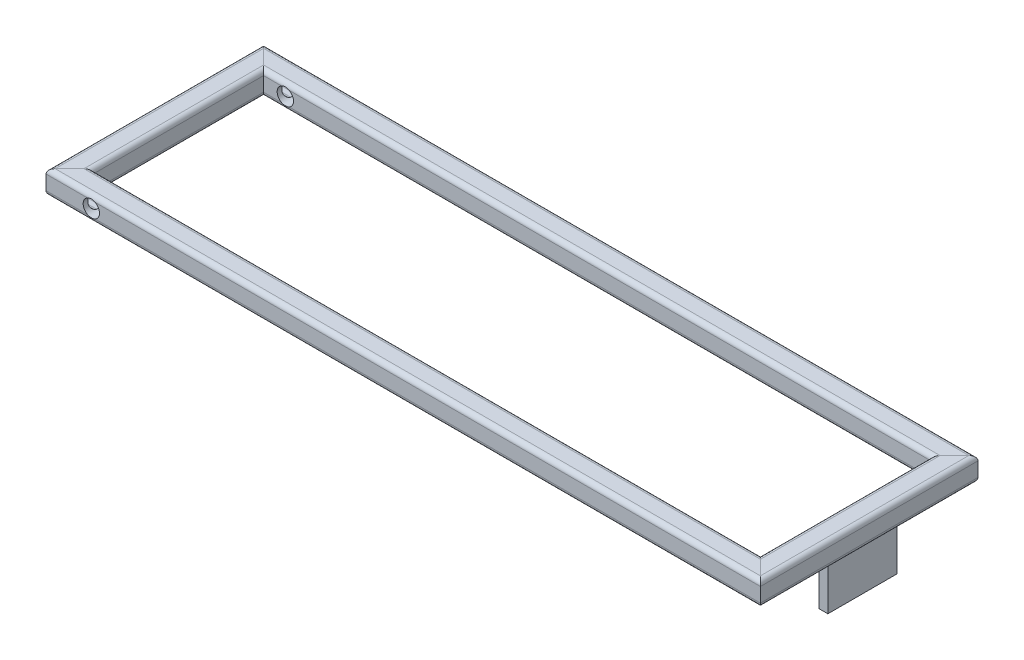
from build123d import *

# Parameters (mm, degrees)
STRUCTURAL_MEMBER1_DEPTH      = 391.192388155
STRUCTURAL_MEMBER1_DEPTH_BACK = 10.192388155
STRUCTURAL_MEMBER1_2_DEPTH    = 127.384776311
STRUCTURAL_MEMBER1_3_DEPTH    = 401.384776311
STRUCTURAL_MEMBER1_4_DEPTH    = 127.384776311
SKETCH12_R                    = 4.5
CUT_EXTRUDE1_DEPTH            = 231.762323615
SKETCH13_W                    = 5
SKETCH13_H                    = 38
BOSS_EXTRUDE1_DEPTH           = 25


with BuildPart() as part:
    # Sketch11 → Structural Member1 (new, two sides: drawn at the far end of the back side and taken through both)
    with BuildSketch(Plane(origin=(-190.5, 0, 53.5), x_dir=(0, 0, -1), z_dir=(1, 0, 0)).offset(-STRUCTURAL_MEMBER1_DEPTH_BACK)):
        with BuildLine():
            Line((-3.96, 6.5), (3.96, 6.5))
            ThreePointArc((3.96, 6.5), (5.756051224, 5.756051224), (6.5, 3.96))
            Line((6.5, 3.96), (6.5, -3.96))
            ThreePointArc((6.5, -3.96), (5.756051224, -5.756051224), (3.96, -6.5))
            Line((3.96, -6.5), (-3.96, -6.5))
            ThreePointArc((-3.96, -6.5), (-5.756051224, -5.756051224), (-6.5, -3.96))
            Line((-6.5, -3.96), (-6.5, 3.96))
            ThreePointArc((-6.5, 3.96), (-5.756051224, 5.756051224), (-3.96, 6.5))
        make_face()
        with BuildLine():
            Line((-1.42, 3.96), (1.42, 3.96))
            ThreePointArc((1.42, 3.96), (3.216051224, 3.216051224), (3.96, 1.42))
            Line((3.96, 1.42), (3.96, -1.42))
            ThreePointArc((3.96, -1.42), (3.216051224, -3.216051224), (1.42, -3.96))
            Line((1.42, -3.96), (-1.42, -3.96))
            ThreePointArc((-1.42, -3.96), (-3.216051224, -3.216051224), (-3.96, -1.42))
            Line((-3.96, -1.42), (-3.96, 1.42))
            ThreePointArc((-3.96, 1.42), (-3.216051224, 3.216051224), (-1.42, 3.96))
        make_face(mode=Mode.SUBTRACT)
    extrude(amount=STRUCTURAL_MEMBER1_DEPTH + STRUCTURAL_MEMBER1_DEPTH_BACK)

    # Structural Member1 mitre 1
    split(bisect_by=Plane(origin=(-190.5, 0, 53.5), x_dir=(0, 1, 0), z_dir=(0.707106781, 0, 0.707106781)), keep=Keep.TOP)

    # Structural Member1 mitre 2
    split(bisect_by=Plane(origin=(190.5, 0, 53.5), x_dir=(0, -1, 0), z_dir=(-0.707106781, 0, 0.707106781)), keep=Keep.TOP)


with BuildPart() as body_2:
    # Sketch11 on segment 2 (on carried to segment 2) → Structural Member1 2 (new body)
    with BuildSketch(Plane(origin=(190.5, 0, 63.692388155), x_dir=(-1, 0, 0), z_dir=(0, 0, -1))):
        with BuildLine():
            Line((-3.96, 6.5), (3.96, 6.5))
            ThreePointArc((3.96, 6.5), (5.756051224, 5.756051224), (6.5, 3.96))
            Line((6.5, 3.96), (6.5, -3.96))
            ThreePointArc((6.5, -3.96), (5.756051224, -5.756051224), (3.96, -6.5))
            Line((3.96, -6.5), (-3.96, -6.5))
            ThreePointArc((-3.96, -6.5), (-5.756051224, -5.756051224), (-6.5, -3.96))
            Line((-6.5, -3.96), (-6.5, 3.96))
            ThreePointArc((-6.5, 3.96), (-5.756051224, 5.756051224), (-3.96, 6.5))
        make_face()
        with BuildLine():
            Line((-1.42, 3.96), (1.42, 3.96))
            ThreePointArc((1.42, 3.96), (3.216051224, 3.216051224), (3.96, 1.42))
            Line((3.96, 1.42), (3.96, -1.42))
            ThreePointArc((3.96, -1.42), (3.216051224, -3.216051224), (1.42, -3.96))
            Line((1.42, -3.96), (-1.42, -3.96))
            ThreePointArc((-1.42, -3.96), (-3.216051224, -3.216051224), (-3.96, -1.42))
            Line((-3.96, -1.42), (-3.96, 1.42))
            ThreePointArc((-3.96, 1.42), (-3.216051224, 3.216051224), (-1.42, 3.96))
        make_face(mode=Mode.SUBTRACT)
    extrude(amount=STRUCTURAL_MEMBER1_2_DEPTH)

    # Structural Member1 2 mitre 1
    split(bisect_by=Plane(origin=(190.5, 0, -53.5), x_dir=(0, 1, 0), z_dir=(0.707106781, 0, 0.707106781)), keep=Keep.TOP)

    # Structural Member1 2 mitre 2
    split(bisect_by=Plane(origin=(190.5, 0, 53.5), x_dir=(0, 1, 0), z_dir=(0.707106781, 0, -0.707106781)), keep=Keep.TOP)


with BuildPart() as body_3:
    # Sketch11 on segment 3 (on carried to segment 3) → Structural Member1 3 (new body)
    with BuildSketch(Plane(origin=(200.692388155, 0, -53.5), x_dir=(0, 0, 1), z_dir=(-1, 0, 0))):
        with BuildLine():
            Line((-3.96, 6.5), (3.96, 6.5))
            ThreePointArc((3.96, 6.5), (5.756051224, 5.756051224), (6.5, 3.96))
            Line((6.5, 3.96), (6.5, -3.96))
            ThreePointArc((6.5, -3.96), (5.756051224, -5.756051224), (3.96, -6.5))
            Line((3.96, -6.5), (-3.96, -6.5))
            ThreePointArc((-3.96, -6.5), (-5.756051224, -5.756051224), (-6.5, -3.96))
            Line((-6.5, -3.96), (-6.5, 3.96))
            ThreePointArc((-6.5, 3.96), (-5.756051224, 5.756051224), (-3.96, 6.5))
        make_face()
        with BuildLine():
            Line((-1.42, 3.96), (1.42, 3.96))
            ThreePointArc((1.42, 3.96), (3.216051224, 3.216051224), (3.96, 1.42))
            Line((3.96, 1.42), (3.96, -1.42))
            ThreePointArc((3.96, -1.42), (3.216051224, -3.216051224), (1.42, -3.96))
            Line((1.42, -3.96), (-1.42, -3.96))
            ThreePointArc((-1.42, -3.96), (-3.216051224, -3.216051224), (-3.96, -1.42))
            Line((-3.96, -1.42), (-3.96, 1.42))
            ThreePointArc((-3.96, 1.42), (-3.216051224, 3.216051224), (-1.42, 3.96))
        make_face(mode=Mode.SUBTRACT)
    extrude(amount=STRUCTURAL_MEMBER1_3_DEPTH)

    # Structural Member1 3 mitre 1
    split(bisect_by=Plane(origin=(-190.5, 0, -53.5), x_dir=(0, 1, 0), z_dir=(0.707106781, 0, -0.707106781)), keep=Keep.TOP)

    # Structural Member1 3 mitre 2
    split(bisect_by=Plane(origin=(190.5, 0, -53.5), x_dir=(0, -1, 0), z_dir=(-0.707106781, 0, -0.707106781)), keep=Keep.TOP)


with BuildPart() as body_4:
    # Sketch11 on segment 4 (on carried to segment 4) → Structural Member1 4 (new body)
    with BuildSketch(Plane(origin=(-190.5, 0, -63.692388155), x_dir=(1, 0, 0), z_dir=(0, 0, 1))):
        with BuildLine():
            Line((-3.96, 6.5), (3.96, 6.5))
            ThreePointArc((3.96, 6.5), (5.756051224, 5.756051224), (6.5, 3.96))
            Line((6.5, 3.96), (6.5, -3.96))
            ThreePointArc((6.5, -3.96), (5.756051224, -5.756051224), (3.96, -6.5))
            Line((3.96, -6.5), (-3.96, -6.5))
            ThreePointArc((-3.96, -6.5), (-5.756051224, -5.756051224), (-6.5, -3.96))
            Line((-6.5, -3.96), (-6.5, 3.96))
            ThreePointArc((-6.5, 3.96), (-5.756051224, 5.756051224), (-3.96, 6.5))
        make_face()
        with BuildLine():
            Line((-1.42, 3.96), (1.42, 3.96))
            ThreePointArc((1.42, 3.96), (3.216051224, 3.216051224), (3.96, 1.42))
            Line((3.96, 1.42), (3.96, -1.42))
            ThreePointArc((3.96, -1.42), (3.216051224, -3.216051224), (1.42, -3.96))
            Line((1.42, -3.96), (-1.42, -3.96))
            ThreePointArc((-1.42, -3.96), (-3.216051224, -3.216051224), (-3.96, -1.42))
            Line((-3.96, -1.42), (-3.96, 1.42))
            ThreePointArc((-3.96, 1.42), (-3.216051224, 3.216051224), (-1.42, 3.96))
        make_face(mode=Mode.SUBTRACT)
    extrude(amount=STRUCTURAL_MEMBER1_4_DEPTH)

    # Structural Member1 4 mitre 1
    split(bisect_by=Plane(origin=(-190.5, 0, -53.5), x_dir=(0, -1, 0), z_dir=(-0.707106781, 0, 0.707106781)), keep=Keep.TOP)

    # Structural Member1 4 mitre 2
    split(bisect_by=Plane(origin=(-190.5, 0, 53.5), x_dir=(0, -1, 0), z_dir=(-0.707106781, 0, -0.707106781)), keep=Keep.TOP)


with BuildPart() as cut_extrude1_tool:
    # Sketch12 → Cut-Extrude1 (new, through all)
    with BuildSketch(Plane.XY.offset(60)):
        with Locations(Location((-172, 0, 0), (0, 0, 61.642363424))):
            Circle(SKETCH12_R)
    extrude(amount=-CUT_EXTRUDE1_DEPTH)


with BuildPart() as part_1:
    add(part.part)

    # Cut-Extrude1: cut by cut_extrude1_tool
    add(cut_extrude1_tool.part, mode=Mode.SUBTRACT)


with BuildPart() as body_3_1:
    add(body_3.part)

    # Cut-Extrude1: cut by cut_extrude1_tool
    add(cut_extrude1_tool.part, mode=Mode.SUBTRACT)


with BuildPart() as body_5:
    # Sketch13 → Boss-Extrude1 (new body)
    with BuildSketch(Plane.XZ.offset(6.5)):
        with Locations((190.7, 0)):
            Rectangle(SKETCH13_W, SKETCH13_H)
    extrude(amount=BOSS_EXTRUDE1_DEPTH)


solid = Compound([body_2.part, body_4.part, part_1.part, body_3_1.part, body_5.part])
